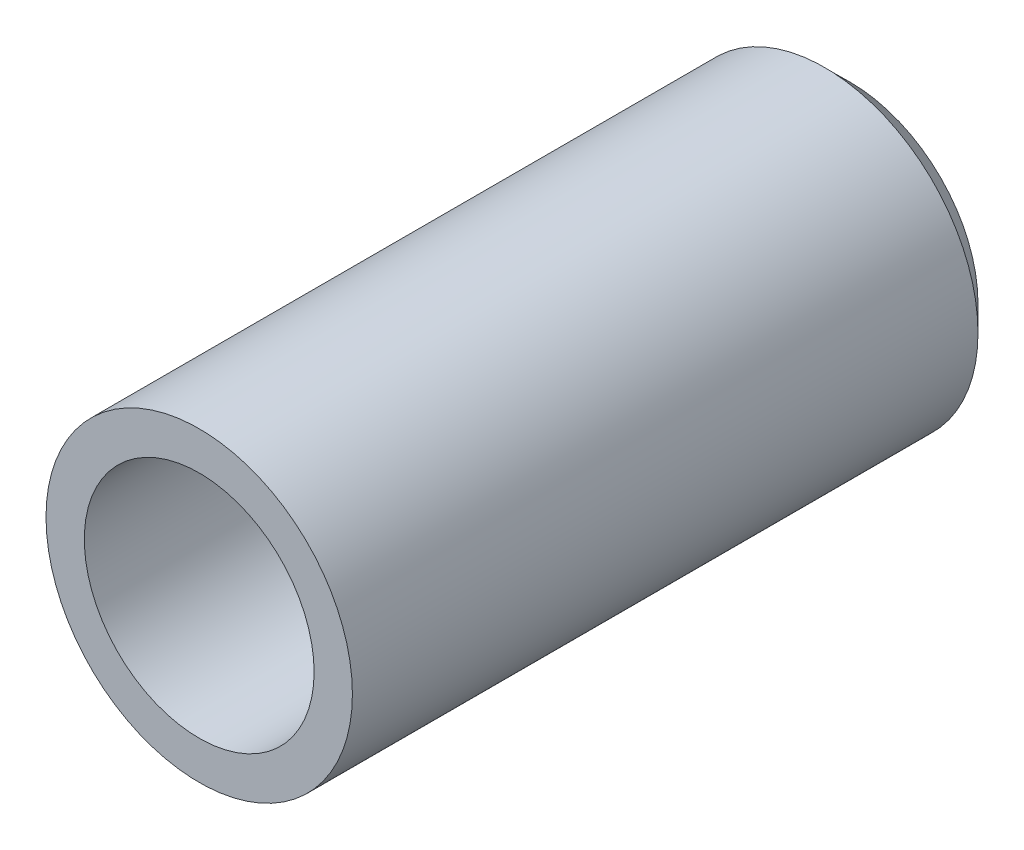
ISO-10303-21;
HEADER;
FILE_DESCRIPTION(('STEP AP214'),'2;1');
FILE_NAME('part.step','',(''),(''),'','','');
FILE_SCHEMA(('AUTOMOTIVE_DESIGN { 1 0 10303 214 1 1 1 1 }'));
ENDSEC;
DATA;
#1=APPLICATION_CONTEXT('core data for automotive mechanical design processes');
#2=APPLICATION_PROTOCOL_DEFINITION('international standard','automotive_design',2000,#1);
#3=PRODUCT_CONTEXT('',#1,'mechanical');
#4=PRODUCT('Part','Part','',(#3));
#5=PRODUCT_RELATED_PRODUCT_CATEGORY('part','',(#4));
#6=PRODUCT_DEFINITION_FORMATION('','',#4);
#7=PRODUCT_DEFINITION_CONTEXT('part definition',#1,'design');
#8=PRODUCT_DEFINITION('design','',#6,#7);
#9=PRODUCT_DEFINITION_SHAPE('','',#8);
#10=(LENGTH_UNIT() NAMED_UNIT(*) SI_UNIT(.MILLI.,.METRE.));
#11=(NAMED_UNIT(*) PLANE_ANGLE_UNIT() SI_UNIT($,.RADIAN.));
#12=(NAMED_UNIT(*) SI_UNIT($,.STERADIAN.) SOLID_ANGLE_UNIT());
#13=UNCERTAINTY_MEASURE_WITH_UNIT(LENGTH_MEASURE(1.E-05),#10,'distance_accuracy_value','');
#14=(GEOMETRIC_REPRESENTATION_CONTEXT(3) GLOBAL_UNCERTAINTY_ASSIGNED_CONTEXT((#13)) GLOBAL_UNIT_ASSIGNED_CONTEXT((#10,
#11,#12)) REPRESENTATION_CONTEXT('',''));
#15=CARTESIAN_POINT('',(0.,0.,0.));
#16=DIRECTION('',(0.,0.,1.));
#17=DIRECTION('',(1.,0.,0.));
#18=AXIS2_PLACEMENT_3D('',#15,#16,#17);
#19=CARTESIAN_POINT('',(0.,0.,25.5));
#20=DIRECTION('',(0.,0.,-1.));
#21=DIRECTION('',(-1.,0.,0.));
#22=AXIS2_PLACEMENT_3D('',#19,#20,#21);
#23=CYLINDRICAL_SURFACE('',#22,6.);
#24=CARTESIAN_POINT('',(0.,0.,1.));
#25=DIRECTION('',(0.,0.,1.));
#26=DIRECTION('',(1.,0.,0.));
#27=AXIS2_PLACEMENT_3D('',#24,#25,#26);
#28=CIRCLE('',#27,6.);
#29=CARTESIAN_POINT('',(6.,0.,1.));
#30=VERTEX_POINT('',#29);
#31=EDGE_CURVE('E48',#30,#30,#28,.T.);
#32=ORIENTED_EDGE('',*,*,#31,.T.);
#33=EDGE_LOOP('',(#32));
#34=FACE_BOUND('',#33,.T.);
#35=CARTESIAN_POINT('',(0.,0.,25.5));
#36=DIRECTION('',(0.,0.,1.));
#37=DIRECTION('',(1.,0.,0.));
#38=AXIS2_PLACEMENT_3D('',#35,#36,#37);
#39=CIRCLE('',#38,6.);
#40=CARTESIAN_POINT('',(6.,0.,25.5));
#41=VERTEX_POINT('',#40);
#42=EDGE_CURVE('E72',#41,#41,#39,.T.);
#43=ORIENTED_EDGE('',*,*,#42,.F.);
#44=EDGE_LOOP('',(#43));
#45=FACE_BOUND('',#44,.T.);
#46=ADVANCED_FACE('F40',(#34,#45),#23,.T.);
#47=CARTESIAN_POINT('',(0.,0.,25.5));
#48=DIRECTION('',(0.,0.,1.));
#49=DIRECTION('',(1.,0.,0.));
#50=AXIS2_PLACEMENT_3D('',#47,#48,#49);
#51=PLANE('',#50);
#52=CARTESIAN_POINT('',(0.,0.,25.5));
#53=DIRECTION('',(0.,0.,1.));
#54=DIRECTION('',(1.,0.,0.));
#55=AXIS2_PLACEMENT_3D('',#52,#53,#54);
#56=CIRCLE('',#55,4.5);
#57=CARTESIAN_POINT('',(4.5,0.,25.5));
#58=VERTEX_POINT('',#57);
#59=EDGE_CURVE('E76',#58,#58,#56,.T.);
#60=ORIENTED_EDGE('',*,*,#59,.F.);
#61=EDGE_LOOP('',(#60));
#62=FACE_BOUND('',#61,.T.);
#63=ORIENTED_EDGE('',*,*,#42,.T.);
#64=EDGE_LOOP('',(#63));
#65=FACE_BOUND('',#64,.T.);
#66=ADVANCED_FACE('F90',(#62,#65),#51,.T.);
#67=CARTESIAN_POINT('',(0.,0.,0.));
#68=DIRECTION('',(0.,0.,1.));
#69=DIRECTION('',(1.,0.,0.));
#70=AXIS2_PLACEMENT_3D('',#67,#68,#69);
#71=PLANE('',#70);
#72=CARTESIAN_POINT('',(0.,0.,0.));
#73=DIRECTION('',(0.,0.,1.));
#74=DIRECTION('',(1.,0.,0.));
#75=AXIS2_PLACEMENT_3D('',#72,#73,#74);
#76=CIRCLE('',#75,4.99999999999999);
#77=CARTESIAN_POINT('',(4.99999999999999,0.,0.));
#78=VERTEX_POINT('',#77);
#79=EDGE_CURVE('E10',#78,#78,#76,.F.);
#80=ORIENTED_EDGE('',*,*,#79,.T.);
#81=EDGE_LOOP('',(#80));
#82=FACE_BOUND('',#81,.T.);
#83=CARTESIAN_POINT('',(0.,0.,0.));
#84=DIRECTION('',(0.,0.,-1.));
#85=DIRECTION('',(-1.,0.,0.));
#86=AXIS2_PLACEMENT_3D('',#83,#84,#85);
#87=CIRCLE('',#86,3.02);
#88=CARTESIAN_POINT('',(-3.02,0.,0.));
#89=VERTEX_POINT('',#88);
#90=EDGE_CURVE('E80',#89,#89,#87,.T.);
#91=ORIENTED_EDGE('',*,*,#90,.F.);
#92=EDGE_LOOP('',(#91));
#93=FACE_BOUND('',#92,.T.);
#94=ADVANCED_FACE('F87',(#82,#93),#71,.F.);
#95=CARTESIAN_POINT('',(0.,0.,3.));
#96=DIRECTION('',(0.,0.,1.));
#97=DIRECTION('',(1.,0.,0.));
#98=AXIS2_PLACEMENT_3D('',#95,#96,#97);
#99=CYLINDRICAL_SURFACE('',#98,4.5);
#100=CARTESIAN_POINT('',(0.,0.,3.5));
#101=DIRECTION('',(0.,0.,1.));
#102=DIRECTION('',(1.,0.,0.));
#103=AXIS2_PLACEMENT_3D('',#100,#101,#102);
#104=CIRCLE('',#103,4.5);
#105=CARTESIAN_POINT('',(4.5,0.,3.5));
#106=VERTEX_POINT('',#105);
#107=EDGE_CURVE('E53',#106,#106,#104,.F.);
#108=CARTESIAN_POINT('',(4.5,0.,3.5));
#109=CARTESIAN_POINT('',(4.5,0.,3.72916666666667));
#110=CARTESIAN_POINT('',(4.5,0.,3.95833333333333));
#111=CARTESIAN_POINT('',(4.5,0.,4.41666666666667));
#112=CARTESIAN_POINT('',(4.5,0.,4.64583333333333));
#113=CARTESIAN_POINT('',(4.5,0.,5.10416666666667));
#114=CARTESIAN_POINT('',(4.5,0.,5.33333333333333));
#115=CARTESIAN_POINT('',(4.5,0.,5.79166666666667));
#116=CARTESIAN_POINT('',(4.5,0.,6.02083333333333));
#117=CARTESIAN_POINT('',(4.5,0.,6.47916666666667));
#118=CARTESIAN_POINT('',(4.5,0.,6.70833333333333));
#119=CARTESIAN_POINT('',(4.5,0.,7.16666666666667));
#120=CARTESIAN_POINT('',(4.5,0.,7.39583333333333));
#121=CARTESIAN_POINT('',(4.5,0.,7.85416666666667));
#122=CARTESIAN_POINT('',(4.5,0.,8.08333333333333));
#123=CARTESIAN_POINT('',(4.5,0.,8.54166666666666));
#124=CARTESIAN_POINT('',(4.5,0.,8.77083333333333));
#125=CARTESIAN_POINT('',(4.5,0.,9.22916666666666));
#126=CARTESIAN_POINT('',(4.5,0.,9.45833333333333));
#127=CARTESIAN_POINT('',(4.5,0.,9.91666666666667));
#128=CARTESIAN_POINT('',(4.5,0.,10.1458333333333));
#129=CARTESIAN_POINT('',(4.5,0.,10.6041666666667));
#130=CARTESIAN_POINT('',(4.5,0.,10.8333333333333));
#131=CARTESIAN_POINT('',(4.5,0.,11.2916666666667));
#132=CARTESIAN_POINT('',(4.5,0.,11.5208333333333));
#133=CARTESIAN_POINT('',(4.5,0.,11.9791666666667));
#134=CARTESIAN_POINT('',(4.5,0.,12.2083333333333));
#135=CARTESIAN_POINT('',(4.5,0.,12.6666666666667));
#136=CARTESIAN_POINT('',(4.5,0.,12.8958333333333));
#137=CARTESIAN_POINT('',(4.5,0.,13.3541666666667));
#138=CARTESIAN_POINT('',(4.5,0.,13.5833333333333));
#139=CARTESIAN_POINT('',(4.5,0.,14.0416666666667));
#140=CARTESIAN_POINT('',(4.5,0.,14.2708333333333));
#141=CARTESIAN_POINT('',(4.5,0.,14.7291666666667));
#142=CARTESIAN_POINT('',(4.5,0.,14.9583333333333));
#143=CARTESIAN_POINT('',(4.5,0.,15.4166666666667));
#144=CARTESIAN_POINT('',(4.5,0.,15.6458333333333));
#145=CARTESIAN_POINT('',(4.5,0.,16.1041666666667));
#146=CARTESIAN_POINT('',(4.5,0.,16.3333333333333));
#147=CARTESIAN_POINT('',(4.5,0.,16.7916666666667));
#148=CARTESIAN_POINT('',(4.5,0.,17.0208333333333));
#149=CARTESIAN_POINT('',(4.5,0.,17.4791666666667));
#150=CARTESIAN_POINT('',(4.5,0.,17.7083333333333));
#151=CARTESIAN_POINT('',(4.5,0.,18.1666666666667));
#152=CARTESIAN_POINT('',(4.5,0.,18.3958333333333));
#153=CARTESIAN_POINT('',(4.5,0.,18.8541666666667));
#154=CARTESIAN_POINT('',(4.5,0.,19.0833333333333));
#155=CARTESIAN_POINT('',(4.5,0.,19.5416666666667));
#156=CARTESIAN_POINT('',(4.5,0.,19.7708333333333));
#157=CARTESIAN_POINT('',(4.5,0.,20.2291666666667));
#158=CARTESIAN_POINT('',(4.5,0.,20.4583333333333));
#159=CARTESIAN_POINT('',(4.5,0.,20.9166666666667));
#160=CARTESIAN_POINT('',(4.5,0.,21.1458333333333));
#161=CARTESIAN_POINT('',(4.5,0.,21.6041666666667));
#162=CARTESIAN_POINT('',(4.5,0.,21.8333333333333));
#163=CARTESIAN_POINT('',(4.5,0.,22.2916666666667));
#164=CARTESIAN_POINT('',(4.5,0.,22.5208333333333));
#165=CARTESIAN_POINT('',(4.5,0.,22.9791666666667));
#166=CARTESIAN_POINT('',(4.5,0.,23.2083333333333));
#167=CARTESIAN_POINT('',(4.5,0.,23.6666666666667));
#168=CARTESIAN_POINT('',(4.5,0.,23.8958333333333));
#169=CARTESIAN_POINT('',(4.5,0.,24.3541666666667));
#170=CARTESIAN_POINT('',(4.5,0.,24.5833333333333));
#171=CARTESIAN_POINT('',(4.5,0.,25.0416666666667));
#172=CARTESIAN_POINT('',(4.5,0.,25.2708333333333));
#173=CARTESIAN_POINT('',(4.5,0.,25.5));
#174=B_SPLINE_CURVE_WITH_KNOTS('',3,(#108,#109,#110,#111,#112,#113,#114,#115,#116,#117,#118,
#119,#120,#121,#122,#123,#124,#125,#126,#127,#128,#129,#130,#131,#132,#133,#134,#135,#136,#137,
#138,#139,#140,#141,#142,#143,#144,#145,#146,#147,#148,#149,#150,#151,#152,#153,#154,#155,#156,
#157,#158,#159,#160,#161,#162,#163,#164,#165,#166,#167,#168,#169,#170,#171,#172,#173),
.UNSPECIFIED.,.F.,.F.,(4,2,2,2,2,2,2,2,2,2,2,2,2,2,2,2,2,2,2,2,2,2,2,2,2,2,2,2,2,2,2,2,4),(0.,
0.687499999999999,1.375,2.0625,2.75,3.4375,4.125,4.8125,5.5,6.1875,6.875,7.5625,8.25,8.9375,
9.625,10.3125,11.,11.6875,12.375,13.0625,13.75,14.4375,15.125,15.8125,16.5,17.1875,17.875,
18.5625,19.25,19.9375,20.625,21.3125,22.),.UNSPECIFIED.);
#175=EDGE_CURVE('BSEAM89',#106,#58,#174,.T.);
#176=ORIENTED_EDGE('',*,*,#107,.T.);
#177=ORIENTED_EDGE('',*,*,#59,.T.);
#178=ORIENTED_EDGE('',*,*,#175,.T.);
#179=ORIENTED_EDGE('',*,*,#175,.F.);
#180=EDGE_LOOP('',(#176,#178,#177,#179));
#181=FACE_BOUND('',#180,.T.);
#182=ADVANCED_FACE('F89',(#181),#99,.F.);
#183=CARTESIAN_POINT('',(0.,0.,3.));
#184=DIRECTION('',(0.,0.,1.));
#185=DIRECTION('',(1.,0.,0.));
#186=AXIS2_PLACEMENT_3D('',#183,#184,#185);
#187=PLANE('',#186);
#188=CARTESIAN_POINT('',(0.,0.,3.));
#189=DIRECTION('',(0.,0.,1.));
#190=DIRECTION('',(1.,0.,0.));
#191=AXIS2_PLACEMENT_3D('',#188,#189,#190);
#192=CIRCLE('',#191,4.);
#193=CARTESIAN_POINT('',(4.,0.,3.));
#194=VERTEX_POINT('',#193);
#195=EDGE_CURVE('E58',#194,#194,#192,.T.);
#196=ORIENTED_EDGE('',*,*,#195,.T.);
#197=EDGE_LOOP('',(#196));
#198=FACE_BOUND('',#197,.T.);
#199=CARTESIAN_POINT('',(0.,0.,3.));
#200=DIRECTION('',(0.,0.,1.));
#201=DIRECTION('',(1.,0.,0.));
#202=AXIS2_PLACEMENT_3D('',#199,#200,#201);
#203=CIRCLE('',#202,3.52);
#204=CARTESIAN_POINT('',(3.52,0.,3.));
#205=VERTEX_POINT('',#204);
#206=EDGE_CURVE('E64',#205,#205,#203,.F.);
#207=ORIENTED_EDGE('',*,*,#206,.T.);
#208=EDGE_LOOP('',(#207));
#209=FACE_BOUND('',#208,.T.);
#210=ADVANCED_FACE('F96',(#198,#209),#187,.T.);
#211=CARTESIAN_POINT('',(0.,0.,25.5));
#212=DIRECTION('',(0.,0.,-1.));
#213=DIRECTION('',(-1.,0.,0.));
#214=AXIS2_PLACEMENT_3D('',#211,#212,#213);
#215=CYLINDRICAL_SURFACE('',#214,3.02);
#216=CARTESIAN_POINT('',(0.,0.,2.5));
#217=DIRECTION('',(0.,0.,1.));
#218=DIRECTION('',(1.,0.,0.));
#219=AXIS2_PLACEMENT_3D('',#216,#217,#218);
#220=CIRCLE('',#219,3.02);
#221=CARTESIAN_POINT('',(3.02,0.,2.5));
#222=VERTEX_POINT('',#221);
#223=EDGE_CURVE('E68',#222,#222,#220,.T.);
#224=ORIENTED_EDGE('',*,*,#223,.T.);
#225=EDGE_LOOP('',(#224));
#226=FACE_BOUND('',#225,.T.);
#227=ORIENTED_EDGE('',*,*,#90,.T.);
#228=EDGE_LOOP('',(#227));
#229=FACE_BOUND('',#228,.T.);
#230=ADVANCED_FACE('F85',(#226,#229),#215,.F.);
#231=CARTESIAN_POINT('',(0.,0.,2.5));
#232=DIRECTION('',(0.,0.,1.));
#233=DIRECTION('',(1.,0.,0.));
#234=AXIS2_PLACEMENT_3D('',#231,#232,#233);
#235=CONICAL_SURFACE('',#234,3.02,0.78539816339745);
#236=ORIENTED_EDGE('',*,*,#206,.F.);
#237=EDGE_LOOP('',(#236));
#238=FACE_BOUND('',#237,.T.);
#239=ORIENTED_EDGE('',*,*,#223,.F.);
#240=EDGE_LOOP('',(#239));
#241=FACE_BOUND('',#240,.T.);
#242=ADVANCED_FACE('F107',(#238,#241),#235,.F.);
#243=CARTESIAN_POINT('',(0.,0.,3.5));
#244=DIRECTION('',(0.,0.,1.));
#245=DIRECTION('',(1.,0.,0.));
#246=AXIS2_PLACEMENT_3D('',#243,#244,#245);
#247=TOROIDAL_SURFACE('',#246,4.,0.5);
#248=ORIENTED_EDGE('',*,*,#107,.F.);
#249=EDGE_LOOP('',(#248));
#250=FACE_BOUND('',#249,.T.);
#251=ORIENTED_EDGE('',*,*,#195,.F.);
#252=EDGE_LOOP('',(#251));
#253=FACE_BOUND('',#252,.T.);
#254=ADVANCED_FACE('F109',(#250,#253),#247,.F.);
#255=CARTESIAN_POINT('',(0.,0.,1.));
#256=DIRECTION('',(0.,0.,1.));
#257=DIRECTION('',(1.,0.,0.));
#258=AXIS2_PLACEMENT_3D('',#255,#256,#257);
#259=CONICAL_SURFACE('',#258,6.,0.78539816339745);
#260=ORIENTED_EDGE('',*,*,#79,.F.);
#261=EDGE_LOOP('',(#260));
#262=FACE_BOUND('',#261,.T.);
#263=ORIENTED_EDGE('',*,*,#31,.F.);
#264=EDGE_LOOP('',(#263));
#265=FACE_BOUND('',#264,.T.);
#266=ADVANCED_FACE('F42',(#262,#265),#259,.T.);
#267=CLOSED_SHELL('',(#46,#66,#94,#182,#210,#230,#242,#254,#266));
#268=MANIFOLD_SOLID_BREP('B2',#267);
#269=ADVANCED_BREP_SHAPE_REPRESENTATION('',(#18,#268),#14);
#270=SHAPE_DEFINITION_REPRESENTATION(#9,#269);
ENDSEC;
END-ISO-10303-21;
